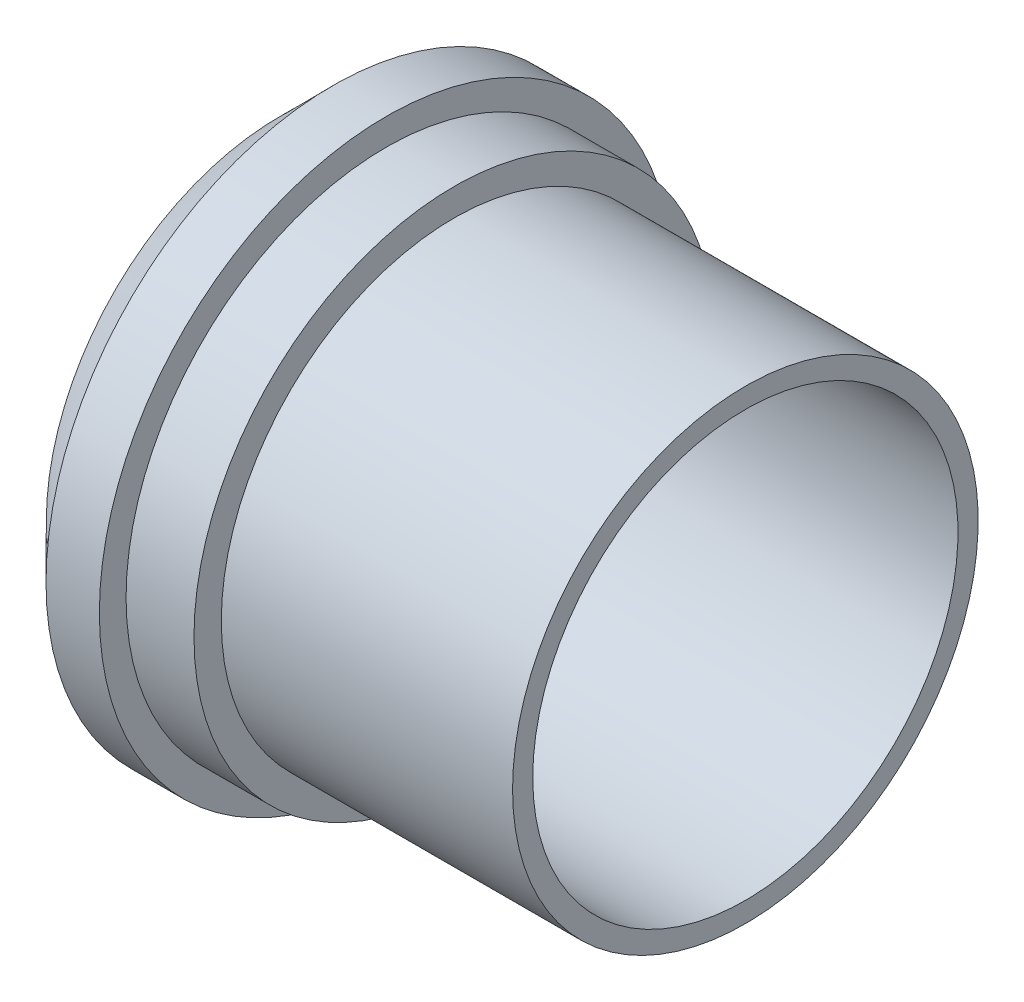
from build123d import *

# Parameters (mm, degrees)
SKETCH4_R          = 17.399
CUT_EXTRUDE1_DEPTH = 38.1


with BuildPart() as part:
    # Sketch1 → Revolve1 (revolve)
    with BuildSketch(Plane.XY, mode=Mode.PRIVATE) as revolve1_sk:
        Polygon((0, 0), (-23.83282, 0), (-23.83282, -2.2352), (-29.39034, -2.2352), (-29.39034, -4.4196), (-33.7566, -4.4196), (-38.1, -0.0508), (-38.1, 19.05), (0, 19.05), align=None)
    revolve(revolve1_sk.sketch.rotate(Axis((-38.1, 19.05, 0), (1, 0, 0)), 270), axis=Axis((-38.1, 19.05, 0), (1, 0, 0)))

    # Sketch4 → Cut-Extrude1 (cut)
    with BuildSketch(Plane.ZY.offset(38.1)):
        with Locations((0, 19.05)):
            Circle(SKETCH4_R)
    extrude(amount=-CUT_EXTRUDE1_DEPTH, mode=Mode.SUBTRACT)


solid = part.part
